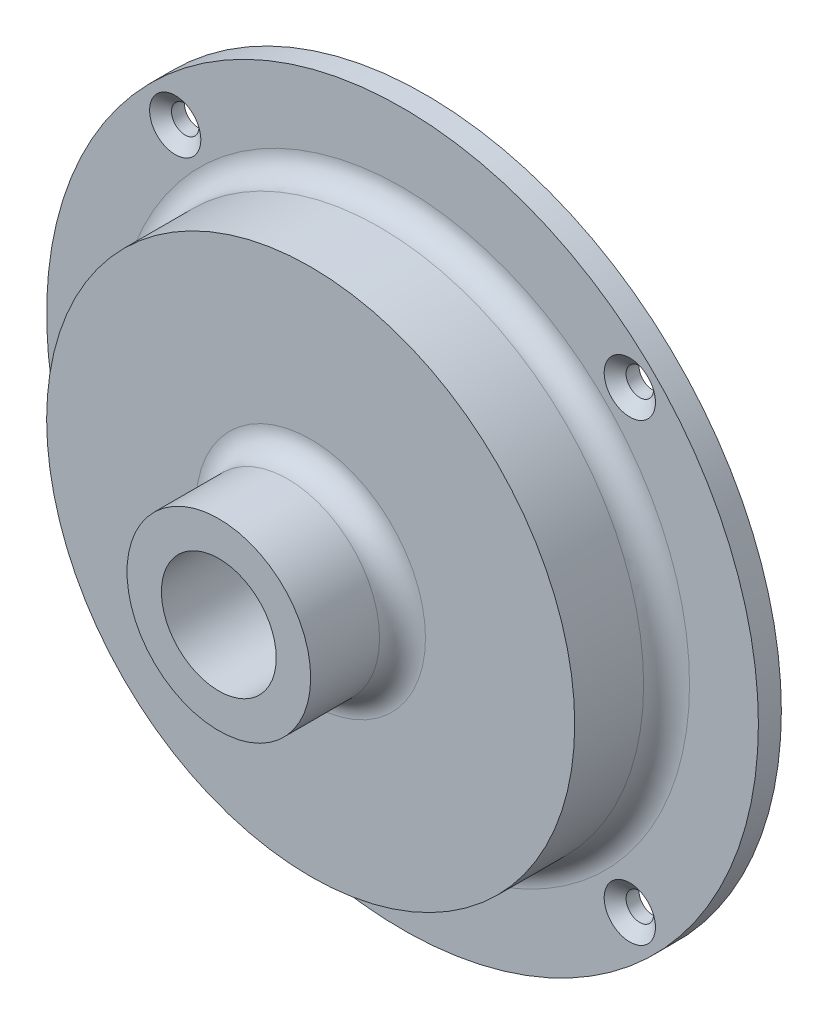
ISO-10303-21;
HEADER;
FILE_DESCRIPTION(('STEP AP214'),'2;1');
FILE_NAME('part.step','',(''),(''),'','','');
FILE_SCHEMA(('AUTOMOTIVE_DESIGN { 1 0 10303 214 1 1 1 1 }'));
ENDSEC;
DATA;
#1=APPLICATION_CONTEXT('core data for automotive mechanical design processes');
#2=APPLICATION_PROTOCOL_DEFINITION('international standard','automotive_design',2000,#1);
#3=PRODUCT_CONTEXT('',#1,'mechanical');
#4=PRODUCT('Part','Part','',(#3));
#5=PRODUCT_RELATED_PRODUCT_CATEGORY('part','',(#4));
#6=PRODUCT_DEFINITION_FORMATION('','',#4);
#7=PRODUCT_DEFINITION_CONTEXT('part definition',#1,'design');
#8=PRODUCT_DEFINITION('design','',#6,#7);
#9=PRODUCT_DEFINITION_SHAPE('','',#8);
#10=(LENGTH_UNIT() NAMED_UNIT(*) SI_UNIT(.MILLI.,.METRE.));
#11=(NAMED_UNIT(*) PLANE_ANGLE_UNIT() SI_UNIT($,.RADIAN.));
#12=(NAMED_UNIT(*) SI_UNIT($,.STERADIAN.) SOLID_ANGLE_UNIT());
#13=UNCERTAINTY_MEASURE_WITH_UNIT(LENGTH_MEASURE(1.E-05),#10,'distance_accuracy_value','');
#14=(GEOMETRIC_REPRESENTATION_CONTEXT(3) GLOBAL_UNCERTAINTY_ASSIGNED_CONTEXT((#13)) GLOBAL_UNIT_ASSIGNED_CONTEXT((#10,
#11,#12)) REPRESENTATION_CONTEXT('',''));
#15=CARTESIAN_POINT('',(0.,0.,0.));
#16=DIRECTION('',(0.,0.,1.));
#17=DIRECTION('',(1.,0.,0.));
#18=AXIS2_PLACEMENT_3D('',#15,#16,#17);
#19=CARTESIAN_POINT('',(0.,0.,15.875));
#20=DIRECTION('',(0.,0.,1.));
#21=DIRECTION('',(1.,0.,0.));
#22=AXIS2_PLACEMENT_3D('',#19,#20,#21);
#23=PLANE('',#22);
#24=CARTESIAN_POINT('',(0.,0.,15.875));
#25=DIRECTION('',(0.,0.,1.));
#26=DIRECTION('',(1.,0.,0.));
#27=AXIS2_PLACEMENT_3D('',#24,#25,#26);
#28=CIRCLE('',#27,15.875);
#29=CARTESIAN_POINT('',(15.875,0.,15.875));
#30=VERTEX_POINT('',#29);
#31=EDGE_CURVE('E37',#30,#30,#28,.F.);
#32=ORIENTED_EDGE('',*,*,#31,.T.);
#33=EDGE_LOOP('',(#32));
#34=FACE_BOUND('',#33,.T.);
#35=CARTESIAN_POINT('',(0.,0.,15.875));
#36=DIRECTION('',(0.,0.,1.));
#37=DIRECTION('',(1.,0.,0.));
#38=AXIS2_PLACEMENT_3D('',#35,#36,#37);
#39=CIRCLE('',#38,36.5125);
#40=CARTESIAN_POINT('',(36.5125,0.,15.875));
#41=VERTEX_POINT('',#40);
#42=EDGE_CURVE('E52',#41,#41,#39,.T.);
#43=ORIENTED_EDGE('',*,*,#42,.T.);
#44=EDGE_LOOP('',(#43));
#45=FACE_BOUND('',#44,.T.);
#46=ADVANCED_FACE('F26',(#34,#45),#23,.T.);
#47=CARTESIAN_POINT('',(0.,0.,3.175));
#48=DIRECTION('',(0.,0.,1.));
#49=DIRECTION('',(1.,0.,0.));
#50=AXIS2_PLACEMENT_3D('',#47,#48,#49);
#51=PLANE('',#50);
#52=CARTESIAN_POINT('',(31.4308964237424,31.4308964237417,3.175));
#53=DIRECTION('',(0.,0.,1.));
#54=DIRECTION('',(1.,0.,0.));
#55=AXIS2_PLACEMENT_3D('',#52,#53,#54);
#56=CIRCLE('',#55,3.5433);
#57=CARTESIAN_POINT('',(34.9741964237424,31.4308964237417,3.175));
#58=VERTEX_POINT('',#57);
#59=EDGE_CURVE('E91',#58,#58,#56,.T.);
#60=ORIENTED_EDGE('',*,*,#59,.F.);
#61=EDGE_LOOP('',(#60));
#62=FACE_BOUND('',#61,.T.);
#63=CARTESIAN_POINT('',(-31.4308964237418,31.4308964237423,3.175));
#64=DIRECTION('',(0.,0.,1.));
#65=DIRECTION('',(1.,0.,0.));
#66=AXIS2_PLACEMENT_3D('',#63,#64,#65);
#67=CIRCLE('',#66,3.5433);
#68=CARTESIAN_POINT('',(-27.8875964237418,31.4308964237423,3.175));
#69=VERTEX_POINT('',#68);
#70=EDGE_CURVE('E82',#69,#69,#67,.T.);
#71=ORIENTED_EDGE('',*,*,#70,.F.);
#72=EDGE_LOOP('',(#71));
#73=FACE_BOUND('',#72,.T.);
#74=CARTESIAN_POINT('',(-31.4308964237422,-31.4308964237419,3.175));
#75=DIRECTION('',(0.,0.,1.));
#76=DIRECTION('',(1.,0.,0.));
#77=AXIS2_PLACEMENT_3D('',#74,#75,#76);
#78=CIRCLE('',#77,3.5433);
#79=CARTESIAN_POINT('',(-27.8875964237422,-31.4308964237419,3.175));
#80=VERTEX_POINT('',#79);
#81=EDGE_CURVE('E73',#80,#80,#78,.T.);
#82=ORIENTED_EDGE('',*,*,#81,.F.);
#83=EDGE_LOOP('',(#82));
#84=FACE_BOUND('',#83,.T.);
#85=CARTESIAN_POINT('',(31.430896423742,-31.4308964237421,3.175));
#86=DIRECTION('',(0.,0.,1.));
#87=DIRECTION('',(1.,0.,0.));
#88=AXIS2_PLACEMENT_3D('',#85,#86,#87);
#89=CIRCLE('',#88,3.5433);
#90=CARTESIAN_POINT('',(34.974196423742,-31.4308964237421,3.175));
#91=VERTEX_POINT('',#90);
#92=EDGE_CURVE('E64',#91,#91,#89,.T.);
#93=ORIENTED_EDGE('',*,*,#92,.F.);
#94=EDGE_LOOP('',(#93));
#95=FACE_BOUND('',#94,.T.);
#96=CARTESIAN_POINT('',(0.,0.,3.175));
#97=DIRECTION('',(0.,0.,1.));
#98=DIRECTION('',(1.,0.,0.));
#99=AXIS2_PLACEMENT_3D('',#96,#97,#98);
#100=CIRCLE('',#99,39.6875);
#101=CARTESIAN_POINT('',(39.6875,0.,3.175));
#102=VERTEX_POINT('',#101);
#103=EDGE_CURVE('E10',#102,#102,#100,.F.);
#104=ORIENTED_EDGE('',*,*,#103,.T.);
#105=EDGE_LOOP('',(#104));
#106=FACE_BOUND('',#105,.T.);
#107=CARTESIAN_POINT('',(0.,0.,3.175));
#108=DIRECTION('',(0.,0.,1.));
#109=DIRECTION('',(1.,0.,0.));
#110=AXIS2_PLACEMENT_3D('',#107,#108,#109);
#111=CIRCLE('',#110,49.2125);
#112=CARTESIAN_POINT('',(49.2125,0.,3.175));
#113=VERTEX_POINT('',#112);
#114=EDGE_CURVE('E46',#113,#113,#111,.T.);
#115=ORIENTED_EDGE('',*,*,#114,.T.);
#116=EDGE_LOOP('',(#115));
#117=FACE_BOUND('',#116,.T.);
#118=ADVANCED_FACE('F117',(#62,#73,#84,#95,#106,#117),#51,.T.);
#119=CARTESIAN_POINT('',(0.,0.,3.175));
#120=DIRECTION('',(0.,0.,-1.));
#121=DIRECTION('',(-1.,0.,0.));
#122=AXIS2_PLACEMENT_3D('',#119,#120,#121);
#123=CYLINDRICAL_SURFACE('',#122,49.2125);
#124=ORIENTED_EDGE('',*,*,#114,.F.);
#125=EDGE_LOOP('',(#124));
#126=FACE_BOUND('',#125,.T.);
#127=CARTESIAN_POINT('',(0.,0.,0.));
#128=DIRECTION('',(0.,0.,1.));
#129=DIRECTION('',(1.,0.,0.));
#130=AXIS2_PLACEMENT_3D('',#127,#128,#129);
#131=CIRCLE('',#130,49.2125);
#132=CARTESIAN_POINT('',(49.2125,0.,0.));
#133=VERTEX_POINT('',#132);
#134=EDGE_CURVE('E49',#133,#133,#131,.T.);
#135=ORIENTED_EDGE('',*,*,#134,.T.);
#136=EDGE_LOOP('',(#135));
#137=FACE_BOUND('',#136,.T.);
#138=ADVANCED_FACE('F28',(#126,#137),#123,.T.);
#139=CARTESIAN_POINT('',(0.,0.,0.));
#140=DIRECTION('',(0.,0.,1.));
#141=DIRECTION('',(1.,0.,0.));
#142=AXIS2_PLACEMENT_3D('',#139,#140,#141);
#143=PLANE('',#142);
#144=CARTESIAN_POINT('',(31.4308964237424,31.4308964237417,0.));
#145=DIRECTION('',(0.,0.,1.));
#146=DIRECTION('',(1.,0.,0.));
#147=AXIS2_PLACEMENT_3D('',#144,#145,#146);
#148=CIRCLE('',#147,1.89865);
#149=CARTESIAN_POINT('',(33.3295464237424,31.4308964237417,0.));
#150=VERTEX_POINT('',#149);
#151=EDGE_CURVE('E97',#150,#150,#148,.T.);
#152=ORIENTED_EDGE('',*,*,#151,.T.);
#153=EDGE_LOOP('',(#152));
#154=FACE_BOUND('',#153,.T.);
#155=CARTESIAN_POINT('',(-31.4308964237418,31.4308964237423,0.));
#156=DIRECTION('',(0.,0.,1.));
#157=DIRECTION('',(1.,0.,0.));
#158=AXIS2_PLACEMENT_3D('',#155,#156,#157);
#159=CIRCLE('',#158,1.89865);
#160=CARTESIAN_POINT('',(-29.5322464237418,31.4308964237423,0.));
#161=VERTEX_POINT('',#160);
#162=EDGE_CURVE('E88',#161,#161,#159,.T.);
#163=ORIENTED_EDGE('',*,*,#162,.T.);
#164=EDGE_LOOP('',(#163));
#165=FACE_BOUND('',#164,.T.);
#166=CARTESIAN_POINT('',(-31.4308964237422,-31.4308964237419,0.));
#167=DIRECTION('',(0.,0.,1.));
#168=DIRECTION('',(1.,0.,0.));
#169=AXIS2_PLACEMENT_3D('',#166,#167,#168);
#170=CIRCLE('',#169,1.89865);
#171=CARTESIAN_POINT('',(-29.5322464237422,-31.4308964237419,0.));
#172=VERTEX_POINT('',#171);
#173=EDGE_CURVE('E79',#172,#172,#170,.T.);
#174=ORIENTED_EDGE('',*,*,#173,.T.);
#175=EDGE_LOOP('',(#174));
#176=FACE_BOUND('',#175,.T.);
#177=CARTESIAN_POINT('',(31.430896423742,-31.4308964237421,0.));
#178=DIRECTION('',(0.,0.,1.));
#179=DIRECTION('',(1.,0.,0.));
#180=AXIS2_PLACEMENT_3D('',#177,#178,#179);
#181=CIRCLE('',#180,1.89865);
#182=CARTESIAN_POINT('',(33.329546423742,-31.4308964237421,0.));
#183=VERTEX_POINT('',#182);
#184=EDGE_CURVE('E70',#183,#183,#181,.T.);
#185=ORIENTED_EDGE('',*,*,#184,.T.);
#186=EDGE_LOOP('',(#185));
#187=FACE_BOUND('',#186,.T.);
#188=CARTESIAN_POINT('',(0.,0.,0.));
#189=DIRECTION('',(0.,0.,1.));
#190=DIRECTION('',(1.,0.,0.));
#191=AXIS2_PLACEMENT_3D('',#188,#189,#190);
#192=CIRCLE('',#191,7.9375);
#193=CARTESIAN_POINT('',(7.9375,0.,0.));
#194=VERTEX_POINT('',#193);
#195=EDGE_CURVE('E58',#194,#194,#192,.T.);
#196=ORIENTED_EDGE('',*,*,#195,.T.);
#197=EDGE_LOOP('',(#196));
#198=FACE_BOUND('',#197,.T.);
#199=ORIENTED_EDGE('',*,*,#134,.F.);
#200=EDGE_LOOP('',(#199));
#201=FACE_BOUND('',#200,.T.);
#202=ADVANCED_FACE('F101',(#154,#165,#176,#187,#198,#201),#143,.F.);
#203=CARTESIAN_POINT('',(0.,0.,15.875));
#204=DIRECTION('',(0.,0.,-1.));
#205=DIRECTION('',(-1.,0.,0.));
#206=AXIS2_PLACEMENT_3D('',#203,#204,#205);
#207=CYLINDRICAL_SURFACE('',#206,36.5125);
#208=CARTESIAN_POINT('',(0.,0.,6.35));
#209=DIRECTION('',(0.,0.,1.));
#210=DIRECTION('',(1.,0.,0.));
#211=AXIS2_PLACEMENT_3D('',#208,#209,#210);
#212=CIRCLE('',#211,36.5125);
#213=CARTESIAN_POINT('',(36.5125,0.,6.35));
#214=VERTEX_POINT('',#213);
#215=EDGE_CURVE('E33',#214,#214,#212,.T.);
#216=ORIENTED_EDGE('',*,*,#215,.T.);
#217=EDGE_LOOP('',(#216));
#218=FACE_BOUND('',#217,.T.);
#219=ORIENTED_EDGE('',*,*,#42,.F.);
#220=EDGE_LOOP('',(#219));
#221=FACE_BOUND('',#220,.T.);
#222=ADVANCED_FACE('F133',(#218,#221),#207,.T.);
#223=CARTESIAN_POINT('',(0.,0.,28.575));
#224=DIRECTION('',(0.,0.,-1.));
#225=DIRECTION('',(-1.,0.,0.));
#226=AXIS2_PLACEMENT_3D('',#223,#224,#225);
#227=CYLINDRICAL_SURFACE('',#226,12.7);
#228=CARTESIAN_POINT('',(0.,0.,19.05));
#229=DIRECTION('',(0.,0.,1.));
#230=DIRECTION('',(1.,0.,0.));
#231=AXIS2_PLACEMENT_3D('',#228,#229,#230);
#232=CIRCLE('',#231,12.7);
#233=CARTESIAN_POINT('',(12.7,0.,19.05));
#234=VERTEX_POINT('',#233);
#235=EDGE_CURVE('E41',#234,#234,#232,.T.);
#236=ORIENTED_EDGE('',*,*,#235,.T.);
#237=EDGE_LOOP('',(#236));
#238=FACE_BOUND('',#237,.T.);
#239=CARTESIAN_POINT('',(0.,0.,28.575));
#240=DIRECTION('',(0.,0.,1.));
#241=DIRECTION('',(1.,0.,0.));
#242=AXIS2_PLACEMENT_3D('',#239,#240,#241);
#243=CIRCLE('',#242,12.7);
#244=CARTESIAN_POINT('',(12.7,0.,28.575));
#245=VERTEX_POINT('',#244);
#246=EDGE_CURVE('E55',#245,#245,#243,.T.);
#247=ORIENTED_EDGE('',*,*,#246,.F.);
#248=EDGE_LOOP('',(#247));
#249=FACE_BOUND('',#248,.T.);
#250=ADVANCED_FACE('F139',(#238,#249),#227,.T.);
#251=CARTESIAN_POINT('',(0.,0.,28.575));
#252=DIRECTION('',(0.,0.,1.));
#253=DIRECTION('',(1.,0.,0.));
#254=AXIS2_PLACEMENT_3D('',#251,#252,#253);
#255=PLANE('',#254);
#256=CARTESIAN_POINT('',(0.,0.,28.575));
#257=DIRECTION('',(0.,0.,1.));
#258=DIRECTION('',(1.,0.,0.));
#259=AXIS2_PLACEMENT_3D('',#256,#257,#258);
#260=CIRCLE('',#259,7.9375);
#261=CARTESIAN_POINT('',(7.9375,0.,28.575));
#262=VERTEX_POINT('',#261);
#263=EDGE_CURVE('E61',#262,#262,#260,.T.);
#264=ORIENTED_EDGE('',*,*,#263,.F.);
#265=EDGE_LOOP('',(#264));
#266=FACE_BOUND('',#265,.T.);
#267=ORIENTED_EDGE('',*,*,#246,.T.);
#268=EDGE_LOOP('',(#267));
#269=FACE_BOUND('',#268,.T.);
#270=ADVANCED_FACE('F150',(#266,#269),#255,.T.);
#271=CARTESIAN_POINT('',(0.,0.,19.05));
#272=DIRECTION('',(0.,0.,1.));
#273=DIRECTION('',(1.,0.,0.));
#274=AXIS2_PLACEMENT_3D('',#271,#272,#273);
#275=TOROIDAL_SURFACE('',#274,15.875,3.175);
#276=ORIENTED_EDGE('',*,*,#31,.F.);
#277=EDGE_LOOP('',(#276));
#278=FACE_BOUND('',#277,.T.);
#279=ORIENTED_EDGE('',*,*,#235,.F.);
#280=EDGE_LOOP('',(#279));
#281=FACE_BOUND('',#280,.T.);
#282=ADVANCED_FACE('F154',(#278,#281),#275,.F.);
#283=CARTESIAN_POINT('',(0.,0.,6.35));
#284=DIRECTION('',(0.,0.,1.));
#285=DIRECTION('',(1.,0.,0.));
#286=AXIS2_PLACEMENT_3D('',#283,#284,#285);
#287=TOROIDAL_SURFACE('',#286,39.6875,3.175);
#288=ORIENTED_EDGE('',*,*,#103,.F.);
#289=EDGE_LOOP('',(#288));
#290=FACE_BOUND('',#289,.T.);
#291=ORIENTED_EDGE('',*,*,#215,.F.);
#292=EDGE_LOOP('',(#291));
#293=FACE_BOUND('',#292,.T.);
#294=ADVANCED_FACE('F158',(#290,#293),#287,.F.);
#295=CARTESIAN_POINT('',(0.,0.,0.));
#296=DIRECTION('',(0.,0.,1.));
#297=DIRECTION('',(1.,0.,0.));
#298=AXIS2_PLACEMENT_3D('',#295,#296,#297);
#299=CYLINDRICAL_SURFACE('',#298,7.9375);
#300=ORIENTED_EDGE('',*,*,#195,.F.);
#301=EDGE_LOOP('',(#300));
#302=FACE_BOUND('',#301,.T.);
#303=ORIENTED_EDGE('',*,*,#263,.T.);
#304=EDGE_LOOP('',(#303));
#305=FACE_BOUND('',#304,.T.);
#306=ADVANCED_FACE('F162',(#302,#305),#299,.F.);
#307=CARTESIAN_POINT('',(31.430896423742,-31.4308964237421,3.175));
#308=DIRECTION('',(0.,0.,1.));
#309=DIRECTION('',(1.,0.,0.));
#310=AXIS2_PLACEMENT_3D('',#307,#308,#309);
#311=CONICAL_SURFACE('',#310,3.5433,0.872664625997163);
#312=CARTESIAN_POINT('',(31.430896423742,-31.4308964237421,1.79497479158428));
#313=DIRECTION('',(0.,0.,1.));
#314=DIRECTION('',(1.,0.,0.));
#315=AXIS2_PLACEMENT_3D('',#312,#313,#314);
#316=CIRCLE('',#315,1.89865);
#317=CARTESIAN_POINT('',(33.329546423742,-31.4308964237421,1.79497479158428));
#318=VERTEX_POINT('',#317);
#319=EDGE_CURVE('E67',#318,#318,#316,.T.);
#320=ORIENTED_EDGE('',*,*,#319,.F.);
#321=EDGE_LOOP('',(#320));
#322=FACE_BOUND('',#321,.T.);
#323=ORIENTED_EDGE('',*,*,#92,.T.);
#324=EDGE_LOOP('',(#323));
#325=FACE_BOUND('',#324,.T.);
#326=ADVANCED_FACE('F166',(#322,#325),#311,.F.);
#327=CARTESIAN_POINT('',(31.430896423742,-31.4308964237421,3.175));
#328=DIRECTION('',(0.,0.,1.));
#329=DIRECTION('',(1.,0.,0.));
#330=AXIS2_PLACEMENT_3D('',#327,#328,#329);
#331=CYLINDRICAL_SURFACE('',#330,1.89865);
#332=ORIENTED_EDGE('',*,*,#184,.F.);
#333=EDGE_LOOP('',(#332));
#334=FACE_BOUND('',#333,.T.);
#335=ORIENTED_EDGE('',*,*,#319,.T.);
#336=EDGE_LOOP('',(#335));
#337=FACE_BOUND('',#336,.T.);
#338=ADVANCED_FACE('F170',(#334,#337),#331,.F.);
#339=CARTESIAN_POINT('',(-31.4308964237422,-31.4308964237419,3.175));
#340=DIRECTION('',(0.,0.,1.));
#341=DIRECTION('',(1.,0.,0.));
#342=AXIS2_PLACEMENT_3D('',#339,#340,#341);
#343=CONICAL_SURFACE('',#342,3.5433,0.872664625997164);
#344=CARTESIAN_POINT('',(-31.4308964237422,-31.4308964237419,1.79497479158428));
#345=DIRECTION('',(0.,0.,1.));
#346=DIRECTION('',(1.,0.,0.));
#347=AXIS2_PLACEMENT_3D('',#344,#345,#346);
#348=CIRCLE('',#347,1.89865);
#349=CARTESIAN_POINT('',(-29.5322464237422,-31.4308964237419,1.79497479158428));
#350=VERTEX_POINT('',#349);
#351=EDGE_CURVE('E76',#350,#350,#348,.T.);
#352=ORIENTED_EDGE('',*,*,#351,.F.);
#353=EDGE_LOOP('',(#352));
#354=FACE_BOUND('',#353,.T.);
#355=ORIENTED_EDGE('',*,*,#81,.T.);
#356=EDGE_LOOP('',(#355));
#357=FACE_BOUND('',#356,.T.);
#358=ADVANCED_FACE('F174',(#354,#357),#343,.F.);
#359=CARTESIAN_POINT('',(-31.4308964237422,-31.4308964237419,3.175));
#360=DIRECTION('',(0.,0.,1.));
#361=DIRECTION('',(1.,0.,0.));
#362=AXIS2_PLACEMENT_3D('',#359,#360,#361);
#363=CYLINDRICAL_SURFACE('',#362,1.89865);
#364=ORIENTED_EDGE('',*,*,#173,.F.);
#365=EDGE_LOOP('',(#364));
#366=FACE_BOUND('',#365,.T.);
#367=ORIENTED_EDGE('',*,*,#351,.T.);
#368=EDGE_LOOP('',(#367));
#369=FACE_BOUND('',#368,.T.);
#370=ADVANCED_FACE('F177',(#366,#369),#363,.F.);
#371=CARTESIAN_POINT('',(-31.4308964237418,31.4308964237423,3.175));
#372=DIRECTION('',(0.,0.,1.));
#373=DIRECTION('',(1.,0.,0.));
#374=AXIS2_PLACEMENT_3D('',#371,#372,#373);
#375=CONICAL_SURFACE('',#374,3.5433,0.872664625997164);
#376=CARTESIAN_POINT('',(-31.4308964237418,31.4308964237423,1.79497479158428));
#377=DIRECTION('',(0.,0.,1.));
#378=DIRECTION('',(1.,0.,0.));
#379=AXIS2_PLACEMENT_3D('',#376,#377,#378);
#380=CIRCLE('',#379,1.89865);
#381=CARTESIAN_POINT('',(-29.5322464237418,31.4308964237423,1.79497479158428));
#382=VERTEX_POINT('',#381);
#383=EDGE_CURVE('E85',#382,#382,#380,.T.);
#384=ORIENTED_EDGE('',*,*,#383,.F.);
#385=EDGE_LOOP('',(#384));
#386=FACE_BOUND('',#385,.T.);
#387=ORIENTED_EDGE('',*,*,#70,.T.);
#388=EDGE_LOOP('',(#387));
#389=FACE_BOUND('',#388,.T.);
#390=ADVANCED_FACE('F181',(#386,#389),#375,.F.);
#391=CARTESIAN_POINT('',(-31.4308964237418,31.4308964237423,3.175));
#392=DIRECTION('',(0.,0.,1.));
#393=DIRECTION('',(1.,0.,0.));
#394=AXIS2_PLACEMENT_3D('',#391,#392,#393);
#395=CYLINDRICAL_SURFACE('',#394,1.89865);
#396=ORIENTED_EDGE('',*,*,#162,.F.);
#397=EDGE_LOOP('',(#396));
#398=FACE_BOUND('',#397,.T.);
#399=ORIENTED_EDGE('',*,*,#383,.T.);
#400=EDGE_LOOP('',(#399));
#401=FACE_BOUND('',#400,.T.);
#402=ADVANCED_FACE('F113',(#398,#401),#395,.F.);
#403=CARTESIAN_POINT('',(31.4308964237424,31.4308964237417,3.175));
#404=DIRECTION('',(0.,0.,1.));
#405=DIRECTION('',(1.,0.,0.));
#406=AXIS2_PLACEMENT_3D('',#403,#404,#405);
#407=CONICAL_SURFACE('',#406,3.5433,0.872664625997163);
#408=CARTESIAN_POINT('',(31.4308964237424,31.4308964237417,1.79497479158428));
#409=DIRECTION('',(0.,0.,1.));
#410=DIRECTION('',(1.,0.,0.));
#411=AXIS2_PLACEMENT_3D('',#408,#409,#410);
#412=CIRCLE('',#411,1.89865);
#413=CARTESIAN_POINT('',(33.3295464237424,31.4308964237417,1.79497479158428));
#414=VERTEX_POINT('',#413);
#415=EDGE_CURVE('E94',#414,#414,#412,.T.);
#416=ORIENTED_EDGE('',*,*,#415,.F.);
#417=EDGE_LOOP('',(#416));
#418=FACE_BOUND('',#417,.T.);
#419=ORIENTED_EDGE('',*,*,#59,.T.);
#420=EDGE_LOOP('',(#419));
#421=FACE_BOUND('',#420,.T.);
#422=ADVANCED_FACE('F107',(#418,#421),#407,.F.);
#423=CARTESIAN_POINT('',(31.4308964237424,31.4308964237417,3.175));
#424=DIRECTION('',(0.,0.,1.));
#425=DIRECTION('',(1.,0.,0.));
#426=AXIS2_PLACEMENT_3D('',#423,#424,#425);
#427=CYLINDRICAL_SURFACE('',#426,1.89865);
#428=ORIENTED_EDGE('',*,*,#151,.F.);
#429=EDGE_LOOP('',(#428));
#430=FACE_BOUND('',#429,.T.);
#431=ORIENTED_EDGE('',*,*,#415,.T.);
#432=EDGE_LOOP('',(#431));
#433=FACE_BOUND('',#432,.T.);
#434=ADVANCED_FACE('F104',(#430,#433),#427,.F.);
#435=CLOSED_SHELL('',(#46,#118,#138,#202,#222,#250,#270,#282,#294,#306,#326,#338,#358,#370,#390,
#402,#422,#434));
#436=MANIFOLD_SOLID_BREP('B2',#435);
#437=ADVANCED_BREP_SHAPE_REPRESENTATION('',(#18,#436),#14);
#438=SHAPE_DEFINITION_REPRESENTATION(#9,#437);
ENDSEC;
END-ISO-10303-21;
